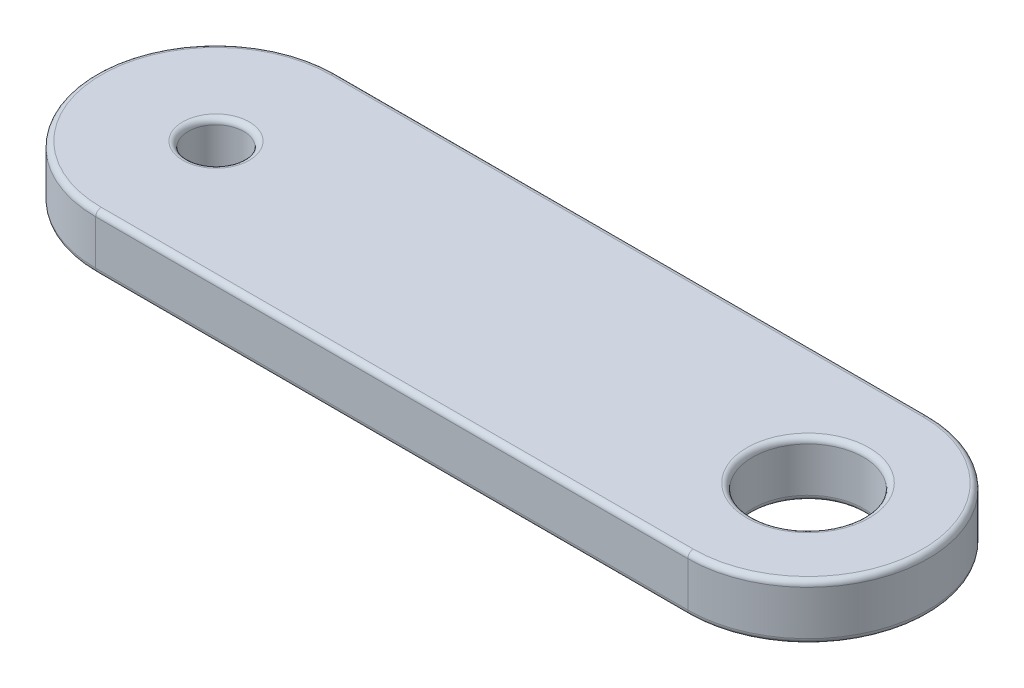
ISO-10303-21;
HEADER;
FILE_DESCRIPTION(('STEP AP214'),'2;1');
FILE_NAME('part.step','',(''),(''),'','','');
FILE_SCHEMA(('AUTOMOTIVE_DESIGN { 1 0 10303 214 1 1 1 1 }'));
ENDSEC;
DATA;
#1=APPLICATION_CONTEXT('core data for automotive mechanical design processes');
#2=APPLICATION_PROTOCOL_DEFINITION('international standard','automotive_design',2000,#1);
#3=PRODUCT_CONTEXT('',#1,'mechanical');
#4=PRODUCT('Part','Part','',(#3));
#5=PRODUCT_RELATED_PRODUCT_CATEGORY('part','',(#4));
#6=PRODUCT_DEFINITION_FORMATION('','',#4);
#7=PRODUCT_DEFINITION_CONTEXT('part definition',#1,'design');
#8=PRODUCT_DEFINITION('design','',#6,#7);
#9=PRODUCT_DEFINITION_SHAPE('','',#8);
#10=(LENGTH_UNIT() NAMED_UNIT(*) SI_UNIT(.MILLI.,.METRE.));
#11=(NAMED_UNIT(*) PLANE_ANGLE_UNIT() SI_UNIT($,.RADIAN.));
#12=(NAMED_UNIT(*) SI_UNIT($,.STERADIAN.) SOLID_ANGLE_UNIT());
#13=UNCERTAINTY_MEASURE_WITH_UNIT(LENGTH_MEASURE(1.E-05),#10,'distance_accuracy_value','');
#14=(GEOMETRIC_REPRESENTATION_CONTEXT(3) GLOBAL_UNCERTAINTY_ASSIGNED_CONTEXT((#13)) GLOBAL_UNIT_ASSIGNED_CONTEXT((#10,
#11,#12)) REPRESENTATION_CONTEXT('',''));
#15=CARTESIAN_POINT('',(0.,0.,0.));
#16=DIRECTION('',(0.,0.,1.));
#17=DIRECTION('',(1.,0.,0.));
#18=AXIS2_PLACEMENT_3D('',#15,#16,#17);
#19=CARTESIAN_POINT('',(-8.,0.75,0.));
#20=DIRECTION('',(0.,1.,0.));
#21=DIRECTION('',(0.,0.,1.));
#22=AXIS2_PLACEMENT_3D('',#19,#20,#21);
#23=PLANE('',#22);
#24=CARTESIAN_POINT('',(8.,0.75,0.));
#25=DIRECTION('',(0.,1.,0.));
#26=DIRECTION('',(0.,0.,1.));
#27=AXIS2_PLACEMENT_3D('',#24,#25,#26);
#28=CIRCLE('',#27,1.65);
#29=CARTESIAN_POINT('',(8.,0.75,1.65));
#30=VERTEX_POINT('',#29);
#31=EDGE_CURVE('E11',#30,#30,#28,.F.);
#32=ORIENTED_EDGE('',*,*,#31,.T.);
#33=EDGE_LOOP('',(#32));
#34=FACE_BOUND('',#33,.T.);
#35=CARTESIAN_POINT('',(8.,0.75,0.));
#36=DIRECTION('',(0.,1.,0.));
#37=DIRECTION('',(0.,0.,1.));
#38=AXIS2_PLACEMENT_3D('',#35,#36,#37);
#39=CIRCLE('',#38,3.1);
#40=CARTESIAN_POINT('',(8.,0.75,3.1));
#41=VERTEX_POINT('',#40);
#42=CARTESIAN_POINT('',(8.,0.75,-3.1));
#43=VERTEX_POINT('',#42);
#44=EDGE_CURVE('E49',#41,#43,#39,.T.);
#45=ORIENTED_EDGE('',*,*,#44,.T.);
#46=DIRECTION('',(-1.,0.,0.));
#47=VECTOR('',#46,1.);
#48=CARTESIAN_POINT('',(-8.,0.75,-3.1));
#49=LINE('',#48,#47);
#50=CARTESIAN_POINT('',(-8.,0.75,-3.1));
#51=VERTEX_POINT('',#50);
#52=EDGE_CURVE('E41',#43,#51,#49,.T.);
#53=ORIENTED_EDGE('',*,*,#52,.T.);
#54=CARTESIAN_POINT('',(-8.,0.75,0.));
#55=DIRECTION('',(0.,1.,0.));
#56=DIRECTION('',(0.,0.,1.));
#57=AXIS2_PLACEMENT_3D('',#54,#55,#56);
#58=CIRCLE('',#57,3.1);
#59=CARTESIAN_POINT('',(-8.,0.75,3.1));
#60=VERTEX_POINT('',#59);
#61=EDGE_CURVE('E167',#51,#60,#58,.T.);
#62=ORIENTED_EDGE('',*,*,#61,.T.);
#63=DIRECTION('',(1.,0.,0.));
#64=VECTOR('',#63,1.);
#65=CARTESIAN_POINT('',(8.,0.75,3.1));
#66=LINE('',#65,#64);
#67=EDGE_CURVE('E54',#60,#41,#66,.T.);
#68=ORIENTED_EDGE('',*,*,#67,.T.);
#69=EDGE_LOOP('',(#45,#53,#62,#68));
#70=FACE_BOUND('',#69,.T.);
#71=CARTESIAN_POINT('',(-8.,0.75,0.));
#72=DIRECTION('',(0.,1.,0.));
#73=DIRECTION('',(0.,0.,1.));
#74=AXIS2_PLACEMENT_3D('',#71,#72,#73);
#75=CIRCLE('',#74,0.899999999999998);
#76=CARTESIAN_POINT('',(-8.,0.75,0.899999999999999));
#77=VERTEX_POINT('',#76);
#78=EDGE_CURVE('E164',#77,#77,#75,.F.);
#79=ORIENTED_EDGE('',*,*,#78,.T.);
#80=EDGE_LOOP('',(#79));
#81=FACE_BOUND('',#80,.T.);
#82=ADVANCED_FACE('F32',(#34,#70,#81),#23,.T.);
#83=CARTESIAN_POINT('',(-8.,-0.75,0.));
#84=DIRECTION('',(0.,1.,0.));
#85=DIRECTION('',(0.,0.,1.));
#86=AXIS2_PLACEMENT_3D('',#83,#84,#85);
#87=PLANE('',#86);
#88=CARTESIAN_POINT('',(8.,-0.75,0.));
#89=DIRECTION('',(0.,1.,0.));
#90=DIRECTION('',(0.,0.,1.));
#91=AXIS2_PLACEMENT_3D('',#88,#89,#90);
#92=CIRCLE('',#91,1.65);
#93=CARTESIAN_POINT('',(8.,-0.75,1.65));
#94=VERTEX_POINT('',#93);
#95=EDGE_CURVE('E129',#94,#94,#92,.T.);
#96=ORIENTED_EDGE('',*,*,#95,.T.);
#97=EDGE_LOOP('',(#96));
#98=FACE_BOUND('',#97,.T.);
#99=CARTESIAN_POINT('',(-8.,-0.75,0.));
#100=DIRECTION('',(0.,1.,0.));
#101=DIRECTION('',(0.,0.,1.));
#102=AXIS2_PLACEMENT_3D('',#99,#100,#101);
#103=CIRCLE('',#102,0.899999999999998);
#104=CARTESIAN_POINT('',(-8.,-0.75,0.899999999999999));
#105=VERTEX_POINT('',#104);
#106=EDGE_CURVE('E126',#105,#105,#103,.T.);
#107=ORIENTED_EDGE('',*,*,#106,.T.);
#108=EDGE_LOOP('',(#107));
#109=FACE_BOUND('',#108,.T.);
#110=CARTESIAN_POINT('',(8.,-0.75,0.));
#111=DIRECTION('',(0.,1.,0.));
#112=DIRECTION('',(0.,0.,1.));
#113=AXIS2_PLACEMENT_3D('',#110,#111,#112);
#114=CIRCLE('',#113,3.1);
#115=CARTESIAN_POINT('',(8.,-0.75,-3.1));
#116=VERTEX_POINT('',#115);
#117=CARTESIAN_POINT('',(8.,-0.75,3.1));
#118=VERTEX_POINT('',#117);
#119=EDGE_CURVE('E125',#116,#118,#114,.F.);
#120=ORIENTED_EDGE('',*,*,#119,.T.);
#121=DIRECTION('',(1.,0.,0.));
#122=VECTOR('',#121,1.);
#123=CARTESIAN_POINT('',(-8.,-0.75,3.1));
#124=LINE('',#123,#122);
#125=CARTESIAN_POINT('',(-8.,-0.75,3.1));
#126=VERTEX_POINT('',#125);
#127=EDGE_CURVE('E104',#118,#126,#124,.F.);
#128=ORIENTED_EDGE('',*,*,#127,.T.);
#129=CARTESIAN_POINT('',(-8.,-0.75,0.));
#130=DIRECTION('',(0.,1.,0.));
#131=DIRECTION('',(0.,0.,1.));
#132=AXIS2_PLACEMENT_3D('',#129,#130,#131);
#133=CIRCLE('',#132,3.1);
#134=CARTESIAN_POINT('',(-8.,-0.75,-3.1));
#135=VERTEX_POINT('',#134);
#136=EDGE_CURVE('E114',#126,#135,#133,.F.);
#137=ORIENTED_EDGE('',*,*,#136,.T.);
#138=DIRECTION('',(-1.,0.,0.));
#139=VECTOR('',#138,1.);
#140=CARTESIAN_POINT('',(-8.,-0.75,-3.1));
#141=LINE('',#140,#139);
#142=EDGE_CURVE('E120',#135,#116,#141,.F.);
#143=ORIENTED_EDGE('',*,*,#142,.T.);
#144=EDGE_LOOP('',(#120,#128,#137,#143));
#145=FACE_BOUND('',#144,.T.);
#146=ADVANCED_FACE('F123',(#98,#109,#145),#87,.F.);
#147=CARTESIAN_POINT('',(-8.,0.75,0.));
#148=DIRECTION('',(0.,-1.,0.));
#149=DIRECTION('',(0.,0.,-1.));
#150=AXIS2_PLACEMENT_3D('',#147,#148,#149);
#151=CYLINDRICAL_SURFACE('',#150,3.25);
#152=DIRECTION('',(0.,-1.,0.));
#153=VECTOR('',#152,1.);
#154=CARTESIAN_POINT('',(-8.,0.75,-3.25));
#155=LINE('',#154,#153);
#156=CARTESIAN_POINT('',(-8.,0.6,-3.25));
#157=VERTEX_POINT('',#156);
#158=CARTESIAN_POINT('',(-8.,-0.6,-3.25));
#159=VERTEX_POINT('',#158);
#160=EDGE_CURVE('E176',#157,#159,#155,.T.);
#161=ORIENTED_EDGE('',*,*,#160,.T.);
#162=CARTESIAN_POINT('',(-8.,-0.6,0.));
#163=DIRECTION('',(0.,1.,0.));
#164=DIRECTION('',(0.,0.,1.));
#165=AXIS2_PLACEMENT_3D('',#162,#163,#164);
#166=CIRCLE('',#165,3.25);
#167=CARTESIAN_POINT('',(-8.,-0.6,3.25));
#168=VERTEX_POINT('',#167);
#169=EDGE_CURVE('E162',#159,#168,#166,.T.);
#170=ORIENTED_EDGE('',*,*,#169,.T.);
#171=DIRECTION('',(0.,-1.,0.));
#172=VECTOR('',#171,1.);
#173=CARTESIAN_POINT('',(-8.,0.75,3.25));
#174=LINE('',#173,#172);
#175=CARTESIAN_POINT('',(-8.,0.6,3.25));
#176=VERTEX_POINT('',#175);
#177=EDGE_CURVE('E121',#176,#168,#174,.T.);
#178=ORIENTED_EDGE('',*,*,#177,.F.);
#179=CARTESIAN_POINT('',(-8.,0.6,0.));
#180=DIRECTION('',(0.,1.,0.));
#181=DIRECTION('',(0.,0.,1.));
#182=AXIS2_PLACEMENT_3D('',#179,#180,#181);
#183=CIRCLE('',#182,3.25);
#184=EDGE_CURVE('E160',#176,#157,#183,.F.);
#185=ORIENTED_EDGE('',*,*,#184,.T.);
#186=EDGE_LOOP('',(#161,#170,#178,#185));
#187=FACE_BOUND('',#186,.T.);
#188=ADVANCED_FACE('F202',(#187),#151,.T.);
#189=CARTESIAN_POINT('',(-8.,0.75,3.25));
#190=DIRECTION('',(0.,0.,-1.));
#191=DIRECTION('',(-1.,0.,0.));
#192=AXIS2_PLACEMENT_3D('',#189,#190,#191);
#193=PLANE('',#192);
#194=ORIENTED_EDGE('',*,*,#177,.T.);
#195=DIRECTION('',(1.,0.,0.));
#196=VECTOR('',#195,1.);
#197=CARTESIAN_POINT('',(-8.,-0.6,3.25));
#198=LINE('',#197,#196);
#199=CARTESIAN_POINT('',(8.,-0.6,3.25));
#200=VERTEX_POINT('',#199);
#201=EDGE_CURVE('E107',#168,#200,#198,.T.);
#202=ORIENTED_EDGE('',*,*,#201,.T.);
#203=DIRECTION('',(0.,-1.,0.));
#204=VECTOR('',#203,1.);
#205=CARTESIAN_POINT('',(8.,0.75,3.25));
#206=LINE('',#205,#204);
#207=CARTESIAN_POINT('',(8.,0.6,3.25));
#208=VERTEX_POINT('',#207);
#209=EDGE_CURVE('E199',#208,#200,#206,.T.);
#210=ORIENTED_EDGE('',*,*,#209,.F.);
#211=DIRECTION('',(1.,0.,0.));
#212=VECTOR('',#211,1.);
#213=CARTESIAN_POINT('',(-8.,0.6,3.25));
#214=LINE('',#213,#212);
#215=EDGE_CURVE('E148',#208,#176,#214,.F.);
#216=ORIENTED_EDGE('',*,*,#215,.T.);
#217=EDGE_LOOP('',(#194,#202,#210,#216));
#218=FACE_BOUND('',#217,.T.);
#219=ADVANCED_FACE('F197',(#218),#193,.F.);
#220=CARTESIAN_POINT('',(8.,0.75,0.));
#221=DIRECTION('',(0.,-1.,0.));
#222=DIRECTION('',(0.,0.,-1.));
#223=AXIS2_PLACEMENT_3D('',#220,#221,#222);
#224=CYLINDRICAL_SURFACE('',#223,3.25);
#225=ORIENTED_EDGE('',*,*,#209,.T.);
#226=CARTESIAN_POINT('',(8.,-0.6,0.));
#227=DIRECTION('',(0.,1.,0.));
#228=DIRECTION('',(0.,0.,1.));
#229=AXIS2_PLACEMENT_3D('',#226,#227,#228);
#230=CIRCLE('',#229,3.25);
#231=CARTESIAN_POINT('',(8.,-0.6,-3.25));
#232=VERTEX_POINT('',#231);
#233=EDGE_CURVE('E153',#200,#232,#230,.T.);
#234=ORIENTED_EDGE('',*,*,#233,.T.);
#235=DIRECTION('',(0.,-1.,0.));
#236=VECTOR('',#235,1.);
#237=CARTESIAN_POINT('',(8.,0.75,-3.25));
#238=LINE('',#237,#236);
#239=CARTESIAN_POINT('',(8.,0.6,-3.25));
#240=VERTEX_POINT('',#239);
#241=EDGE_CURVE('E205',#240,#232,#238,.T.);
#242=ORIENTED_EDGE('',*,*,#241,.F.);
#243=CARTESIAN_POINT('',(8.,0.6,0.));
#244=DIRECTION('',(0.,1.,0.));
#245=DIRECTION('',(0.,0.,1.));
#246=AXIS2_PLACEMENT_3D('',#243,#244,#245);
#247=CIRCLE('',#246,3.25);
#248=EDGE_CURVE('E151',#240,#208,#247,.F.);
#249=ORIENTED_EDGE('',*,*,#248,.T.);
#250=EDGE_LOOP('',(#225,#234,#242,#249));
#251=FACE_BOUND('',#250,.T.);
#252=ADVANCED_FACE('F218',(#251),#224,.T.);
#253=CARTESIAN_POINT('',(-8.,0.75,-3.25));
#254=DIRECTION('',(0.,0.,1.));
#255=DIRECTION('',(1.,0.,0.));
#256=AXIS2_PLACEMENT_3D('',#253,#254,#255);
#257=PLANE('',#256);
#258=ORIENTED_EDGE('',*,*,#241,.T.);
#259=DIRECTION('',(-1.,0.,0.));
#260=VECTOR('',#259,1.);
#261=CARTESIAN_POINT('',(-8.,-0.6,-3.25));
#262=LINE('',#261,#260);
#263=EDGE_CURVE('E158',#232,#159,#262,.T.);
#264=ORIENTED_EDGE('',*,*,#263,.T.);
#265=ORIENTED_EDGE('',*,*,#160,.F.);
#266=DIRECTION('',(-1.,0.,0.));
#267=VECTOR('',#266,1.);
#268=CARTESIAN_POINT('',(8.,0.6,-3.25));
#269=LINE('',#268,#267);
#270=EDGE_CURVE('E155',#157,#240,#269,.F.);
#271=ORIENTED_EDGE('',*,*,#270,.T.);
#272=EDGE_LOOP('',(#258,#264,#265,#271));
#273=FACE_BOUND('',#272,.T.);
#274=ADVANCED_FACE('F222',(#273),#257,.F.);
#275=CARTESIAN_POINT('',(-8.,0.75,0.));
#276=DIRECTION('',(0.,-1.,0.));
#277=DIRECTION('',(0.,0.,-1.));
#278=AXIS2_PLACEMENT_3D('',#275,#276,#277);
#279=CYLINDRICAL_SURFACE('',#278,0.749999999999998);
#280=CARTESIAN_POINT('',(-8.,-0.6,0.));
#281=DIRECTION('',(0.,1.,0.));
#282=DIRECTION('',(0.,0.,1.));
#283=AXIS2_PLACEMENT_3D('',#280,#281,#282);
#284=CIRCLE('',#283,0.749999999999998);
#285=CARTESIAN_POINT('',(-8.,-0.6,0.749999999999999));
#286=VERTEX_POINT('',#285);
#287=EDGE_CURVE('E145',#286,#286,#284,.F.);
#288=ORIENTED_EDGE('',*,*,#287,.T.);
#289=EDGE_LOOP('',(#288));
#290=FACE_BOUND('',#289,.T.);
#291=CARTESIAN_POINT('',(-8.,0.6,0.));
#292=DIRECTION('',(0.,1.,0.));
#293=DIRECTION('',(0.,0.,1.));
#294=AXIS2_PLACEMENT_3D('',#291,#292,#293);
#295=CIRCLE('',#294,0.749999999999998);
#296=CARTESIAN_POINT('',(-8.,0.6,0.749999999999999));
#297=VERTEX_POINT('',#296);
#298=EDGE_CURVE('E142',#297,#297,#295,.T.);
#299=ORIENTED_EDGE('',*,*,#298,.T.);
#300=EDGE_LOOP('',(#299));
#301=FACE_BOUND('',#300,.T.);
#302=ADVANCED_FACE('F238',(#290,#301),#279,.F.);
#303=CARTESIAN_POINT('',(8.,0.75,0.));
#304=DIRECTION('',(0.,-1.,0.));
#305=DIRECTION('',(0.,0.,-1.));
#306=AXIS2_PLACEMENT_3D('',#303,#304,#305);
#307=CYLINDRICAL_SURFACE('',#306,1.5);
#308=CARTESIAN_POINT('',(8.,-0.6,0.));
#309=DIRECTION('',(0.,1.,0.));
#310=DIRECTION('',(0.,0.,1.));
#311=AXIS2_PLACEMENT_3D('',#308,#309,#310);
#312=CIRCLE('',#311,1.5);
#313=CARTESIAN_POINT('',(8.,-0.6,1.5));
#314=VERTEX_POINT('',#313);
#315=EDGE_CURVE('E139',#314,#314,#312,.F.);
#316=ORIENTED_EDGE('',*,*,#315,.T.);
#317=EDGE_LOOP('',(#316));
#318=FACE_BOUND('',#317,.T.);
#319=CARTESIAN_POINT('',(8.,0.6,0.));
#320=DIRECTION('',(0.,1.,0.));
#321=DIRECTION('',(0.,0.,1.));
#322=AXIS2_PLACEMENT_3D('',#319,#320,#321);
#323=CIRCLE('',#322,1.5);
#324=CARTESIAN_POINT('',(8.,0.6,1.5));
#325=VERTEX_POINT('',#324);
#326=EDGE_CURVE('E136',#325,#325,#323,.T.);
#327=ORIENTED_EDGE('',*,*,#326,.T.);
#328=EDGE_LOOP('',(#327));
#329=FACE_BOUND('',#328,.T.);
#330=ADVANCED_FACE('F240',(#318,#329),#307,.F.);
#331=CARTESIAN_POINT('',(8.,-0.6,0.));
#332=DIRECTION('',(0.,1.,0.));
#333=DIRECTION('',(0.,0.,1.));
#334=AXIS2_PLACEMENT_3D('',#331,#332,#333);
#335=TOROIDAL_SURFACE('',#334,1.65,0.15);
#336=ORIENTED_EDGE('',*,*,#315,.F.);
#337=EDGE_LOOP('',(#336));
#338=FACE_BOUND('',#337,.T.);
#339=ORIENTED_EDGE('',*,*,#95,.F.);
#340=EDGE_LOOP('',(#339));
#341=FACE_BOUND('',#340,.T.);
#342=ADVANCED_FACE('F247',(#338,#341),#335,.T.);
#343=CARTESIAN_POINT('',(-8.,-0.6,0.));
#344=DIRECTION('',(0.,1.,0.));
#345=DIRECTION('',(0.,0.,1.));
#346=AXIS2_PLACEMENT_3D('',#343,#344,#345);
#347=TOROIDAL_SURFACE('',#346,0.899999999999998,0.15);
#348=ORIENTED_EDGE('',*,*,#287,.F.);
#349=EDGE_LOOP('',(#348));
#350=FACE_BOUND('',#349,.T.);
#351=ORIENTED_EDGE('',*,*,#106,.F.);
#352=EDGE_LOOP('',(#351));
#353=FACE_BOUND('',#352,.T.);
#354=ADVANCED_FACE('F263',(#350,#353),#347,.T.);
#355=CARTESIAN_POINT('',(-8.,-0.6,-3.1));
#356=DIRECTION('',(-1.,0.,0.));
#357=DIRECTION('',(0.,0.,1.));
#358=AXIS2_PLACEMENT_3D('',#355,#356,#357);
#359=CYLINDRICAL_SURFACE('',#358,0.15);
#360=CARTESIAN_POINT('',(8.,-0.6,-3.1));
#361=DIRECTION('',(1.,0.,0.));
#362=DIRECTION('',(0.,0.,-1.));
#363=AXIS2_PLACEMENT_3D('',#360,#361,#362);
#364=CIRCLE('',#363,0.15);
#365=EDGE_CURVE('E110',#116,#232,#364,.T.);
#366=ORIENTED_EDGE('',*,*,#365,.F.);
#367=ORIENTED_EDGE('',*,*,#142,.F.);
#368=CARTESIAN_POINT('',(-8.,-0.6,-3.1));
#369=DIRECTION('',(-1.,0.,0.));
#370=DIRECTION('',(0.,0.,1.));
#371=AXIS2_PLACEMENT_3D('',#368,#369,#370);
#372=CIRCLE('',#371,0.15);
#373=EDGE_CURVE('E117',#159,#135,#372,.T.);
#374=ORIENTED_EDGE('',*,*,#373,.F.);
#375=ORIENTED_EDGE('',*,*,#263,.F.);
#376=EDGE_LOOP('',(#366,#367,#374,#375));
#377=FACE_BOUND('',#376,.T.);
#378=ADVANCED_FACE('F211',(#377),#359,.T.);
#379=CARTESIAN_POINT('',(-8.,-0.6,0.));
#380=DIRECTION('',(0.,1.,0.));
#381=DIRECTION('',(0.,0.,1.));
#382=AXIS2_PLACEMENT_3D('',#379,#380,#381);
#383=TOROIDAL_SURFACE('',#382,3.1,0.15);
#384=ORIENTED_EDGE('',*,*,#373,.T.);
#385=ORIENTED_EDGE('',*,*,#136,.F.);
#386=CARTESIAN_POINT('',(-8.,-0.6,3.1));
#387=DIRECTION('',(1.,0.,0.));
#388=DIRECTION('',(0.,0.,-1.));
#389=AXIS2_PLACEMENT_3D('',#386,#387,#388);
#390=CIRCLE('',#389,0.15);
#391=EDGE_CURVE('E100',#168,#126,#390,.T.);
#392=ORIENTED_EDGE('',*,*,#391,.F.);
#393=ORIENTED_EDGE('',*,*,#169,.F.);
#394=EDGE_LOOP('',(#384,#385,#392,#393));
#395=FACE_BOUND('',#394,.T.);
#396=ADVANCED_FACE('F115',(#395),#383,.T.);
#397=CARTESIAN_POINT('',(8.,-0.6,0.));
#398=DIRECTION('',(0.,1.,0.));
#399=DIRECTION('',(0.,0.,1.));
#400=AXIS2_PLACEMENT_3D('',#397,#398,#399);
#401=TOROIDAL_SURFACE('',#400,3.1,0.15);
#402=ORIENTED_EDGE('',*,*,#365,.T.);
#403=ORIENTED_EDGE('',*,*,#233,.F.);
#404=CARTESIAN_POINT('',(8.,-0.6,3.1));
#405=DIRECTION('',(-1.,0.,0.));
#406=DIRECTION('',(0.,0.,1.));
#407=AXIS2_PLACEMENT_3D('',#404,#405,#406);
#408=CIRCLE('',#407,0.15);
#409=EDGE_CURVE('E111',#118,#200,#408,.T.);
#410=ORIENTED_EDGE('',*,*,#409,.F.);
#411=ORIENTED_EDGE('',*,*,#119,.F.);
#412=EDGE_LOOP('',(#402,#403,#410,#411));
#413=FACE_BOUND('',#412,.T.);
#414=ADVANCED_FACE('F214',(#413),#401,.T.);
#415=CARTESIAN_POINT('',(-8.,-0.6,3.1));
#416=DIRECTION('',(1.,0.,0.));
#417=DIRECTION('',(0.,0.,-1.));
#418=AXIS2_PLACEMENT_3D('',#415,#416,#417);
#419=CYLINDRICAL_SURFACE('',#418,0.15);
#420=ORIENTED_EDGE('',*,*,#391,.T.);
#421=ORIENTED_EDGE('',*,*,#127,.F.);
#422=ORIENTED_EDGE('',*,*,#409,.T.);
#423=ORIENTED_EDGE('',*,*,#201,.F.);
#424=EDGE_LOOP('',(#420,#421,#422,#423));
#425=FACE_BOUND('',#424,.T.);
#426=ADVANCED_FACE('F102',(#425),#419,.T.);
#427=CARTESIAN_POINT('',(8.,0.6,0.));
#428=DIRECTION('',(0.,1.,0.));
#429=DIRECTION('',(0.,0.,1.));
#430=AXIS2_PLACEMENT_3D('',#427,#428,#429);
#431=TOROIDAL_SURFACE('',#430,1.65,0.15);
#432=ORIENTED_EDGE('',*,*,#31,.F.);
#433=EDGE_LOOP('',(#432));
#434=FACE_BOUND('',#433,.T.);
#435=ORIENTED_EDGE('',*,*,#326,.F.);
#436=EDGE_LOOP('',(#435));
#437=FACE_BOUND('',#436,.T.);
#438=ADVANCED_FACE('F270',(#434,#437),#431,.T.);
#439=CARTESIAN_POINT('',(-8.,0.6,3.1));
#440=DIRECTION('',(-1.,0.,0.));
#441=DIRECTION('',(0.,0.,1.));
#442=AXIS2_PLACEMENT_3D('',#439,#440,#441);
#443=CYLINDRICAL_SURFACE('',#442,0.15);
#444=CARTESIAN_POINT('',(-8.,0.6,3.1));
#445=DIRECTION('',(-1.,0.,0.));
#446=DIRECTION('',(0.,0.,1.));
#447=AXIS2_PLACEMENT_3D('',#444,#445,#446);
#448=CIRCLE('',#447,0.15);
#449=EDGE_CURVE('E180',#176,#60,#448,.T.);
#450=ORIENTED_EDGE('',*,*,#449,.F.);
#451=ORIENTED_EDGE('',*,*,#215,.F.);
#452=CARTESIAN_POINT('',(8.,0.6,3.1));
#453=DIRECTION('',(1.,0.,0.));
#454=DIRECTION('',(0.,0.,-1.));
#455=AXIS2_PLACEMENT_3D('',#452,#453,#454);
#456=CIRCLE('',#455,0.15);
#457=EDGE_CURVE('E36',#41,#208,#456,.T.);
#458=ORIENTED_EDGE('',*,*,#457,.F.);
#459=ORIENTED_EDGE('',*,*,#67,.F.);
#460=EDGE_LOOP('',(#450,#451,#458,#459));
#461=FACE_BOUND('',#460,.T.);
#462=ADVANCED_FACE('F192',(#461),#443,.T.);
#463=CARTESIAN_POINT('',(8.,0.6,0.));
#464=DIRECTION('',(0.,1.,0.));
#465=DIRECTION('',(0.,0.,1.));
#466=AXIS2_PLACEMENT_3D('',#463,#464,#465);
#467=TOROIDAL_SURFACE('',#466,3.1,0.15);
#468=ORIENTED_EDGE('',*,*,#457,.T.);
#469=ORIENTED_EDGE('',*,*,#248,.F.);
#470=CARTESIAN_POINT('',(8.,0.6,-3.1));
#471=DIRECTION('',(-1.,0.,0.));
#472=DIRECTION('',(0.,0.,1.));
#473=AXIS2_PLACEMENT_3D('',#470,#471,#472);
#474=CIRCLE('',#473,0.15);
#475=EDGE_CURVE('E179',#43,#240,#474,.T.);
#476=ORIENTED_EDGE('',*,*,#475,.F.);
#477=ORIENTED_EDGE('',*,*,#44,.F.);
#478=EDGE_LOOP('',(#468,#469,#476,#477));
#479=FACE_BOUND('',#478,.T.);
#480=ADVANCED_FACE('F189',(#479),#467,.T.);
#481=CARTESIAN_POINT('',(-8.,0.6,0.));
#482=DIRECTION('',(0.,1.,0.));
#483=DIRECTION('',(0.,0.,1.));
#484=AXIS2_PLACEMENT_3D('',#481,#482,#483);
#485=TOROIDAL_SURFACE('',#484,3.1,0.15);
#486=ORIENTED_EDGE('',*,*,#449,.T.);
#487=ORIENTED_EDGE('',*,*,#61,.F.);
#488=CARTESIAN_POINT('',(-8.,0.6,-3.1));
#489=DIRECTION('',(1.,0.,0.));
#490=DIRECTION('',(0.,0.,-1.));
#491=AXIS2_PLACEMENT_3D('',#488,#489,#490);
#492=CIRCLE('',#491,0.15);
#493=EDGE_CURVE('E177',#157,#51,#492,.T.);
#494=ORIENTED_EDGE('',*,*,#493,.F.);
#495=ORIENTED_EDGE('',*,*,#184,.F.);
#496=EDGE_LOOP('',(#486,#487,#494,#495));
#497=FACE_BOUND('',#496,.T.);
#498=ADVANCED_FACE('F227',(#497),#485,.T.);
#499=CARTESIAN_POINT('',(-8.,0.6,-3.1));
#500=DIRECTION('',(1.,0.,0.));
#501=DIRECTION('',(0.,0.,-1.));
#502=AXIS2_PLACEMENT_3D('',#499,#500,#501);
#503=CYLINDRICAL_SURFACE('',#502,0.15);
#504=ORIENTED_EDGE('',*,*,#475,.T.);
#505=ORIENTED_EDGE('',*,*,#270,.F.);
#506=ORIENTED_EDGE('',*,*,#493,.T.);
#507=ORIENTED_EDGE('',*,*,#52,.F.);
#508=EDGE_LOOP('',(#504,#505,#506,#507));
#509=FACE_BOUND('',#508,.T.);
#510=ADVANCED_FACE('F225',(#509),#503,.T.);
#511=CARTESIAN_POINT('',(-8.,0.6,0.));
#512=DIRECTION('',(0.,1.,0.));
#513=DIRECTION('',(0.,0.,1.));
#514=AXIS2_PLACEMENT_3D('',#511,#512,#513);
#515=TOROIDAL_SURFACE('',#514,0.899999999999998,0.15);
#516=ORIENTED_EDGE('',*,*,#78,.F.);
#517=EDGE_LOOP('',(#516));
#518=FACE_BOUND('',#517,.T.);
#519=ORIENTED_EDGE('',*,*,#298,.F.);
#520=EDGE_LOOP('',(#519));
#521=FACE_BOUND('',#520,.T.);
#522=ADVANCED_FACE('F34',(#518,#521),#515,.T.);
#523=CLOSED_SHELL('',(#82,#146,#188,#219,#252,#274,#302,#330,#342,#354,#378,#396,#414,#426,#438,
#462,#480,#498,#510,#522));
#524=MANIFOLD_SOLID_BREP('B2',#523);
#525=ADVANCED_BREP_SHAPE_REPRESENTATION('',(#18,#524),#14);
#526=SHAPE_DEFINITION_REPRESENTATION(#9,#525);
ENDSEC;
END-ISO-10303-21;
